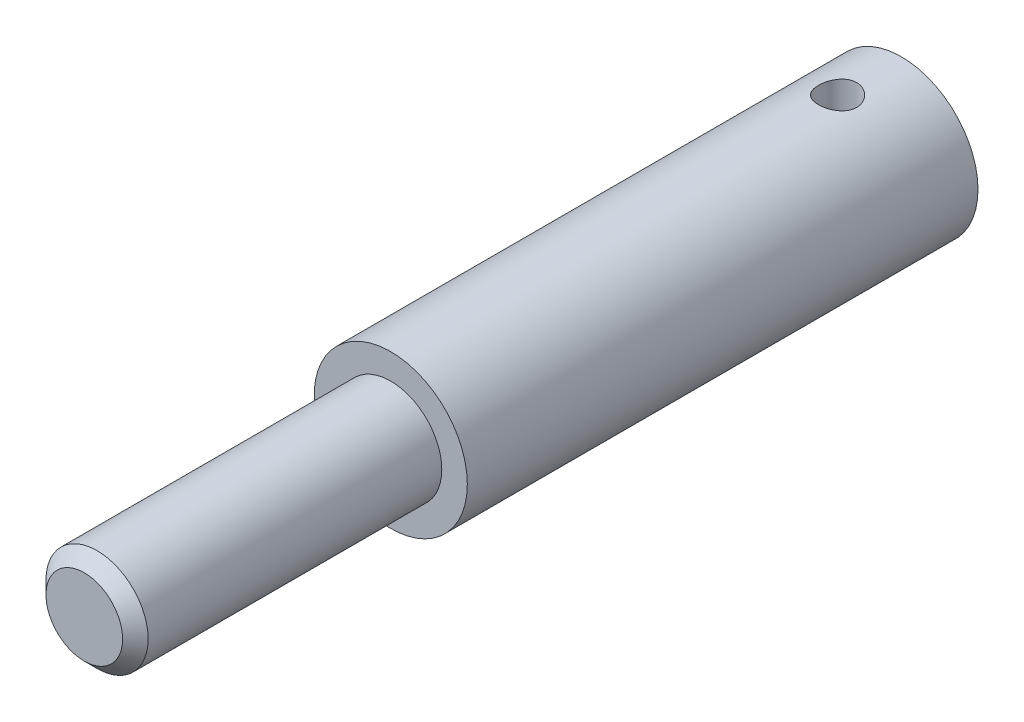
from build123d import *

# Parameters (mm, degrees)
ESQUISSE1_R             = 6
EXTRUSION1_DEPTH        = 40
ESQUISSE2_R             = 4
EXTRUSION2_DEPTH        = 24
CHANFREIN1_SIZE         = 1
ESQUISSE3_R             = 1.5
ENL_V_MAT_EXTRU_1_DEPTH = 11


with BuildPart() as part:
    # Esquisse1 → Extrusion1 (new body)
    with BuildSketch(Plane.XY):
        Circle(ESQUISSE1_R)
    extrude(amount=EXTRUSION1_DEPTH)

    # Esquisse2 → Extrusion2 (add)
    with BuildSketch(Plane.XY.offset(40)):
        Circle(ESQUISSE2_R)
    extrude(amount=EXTRUSION2_DEPTH)

    # Chanfrein1
    chanfrein1_edges = [part.edges().sort_by_distance(p)[0] for p in [
        (-4, 0, 64),
    ]]
    chamfer(chanfrein1_edges, length=CHANFREIN1_SIZE)

    # Esquisse3 → Enl_v. mat.-Extru.1 (cut, symmetric)
    with BuildSketch(Plane(origin=(0, 0, 0), x_dir=(1, 0, 0), z_dir=(0, 1, 0))):
        with Locations(Location((0, -5, 0), (0, 0, 270))):
            Circle(ESQUISSE3_R)
    extrude(amount=ENL_V_MAT_EXTRU_1_DEPTH, both=True, mode=Mode.SUBTRACT)


solid = part.part
